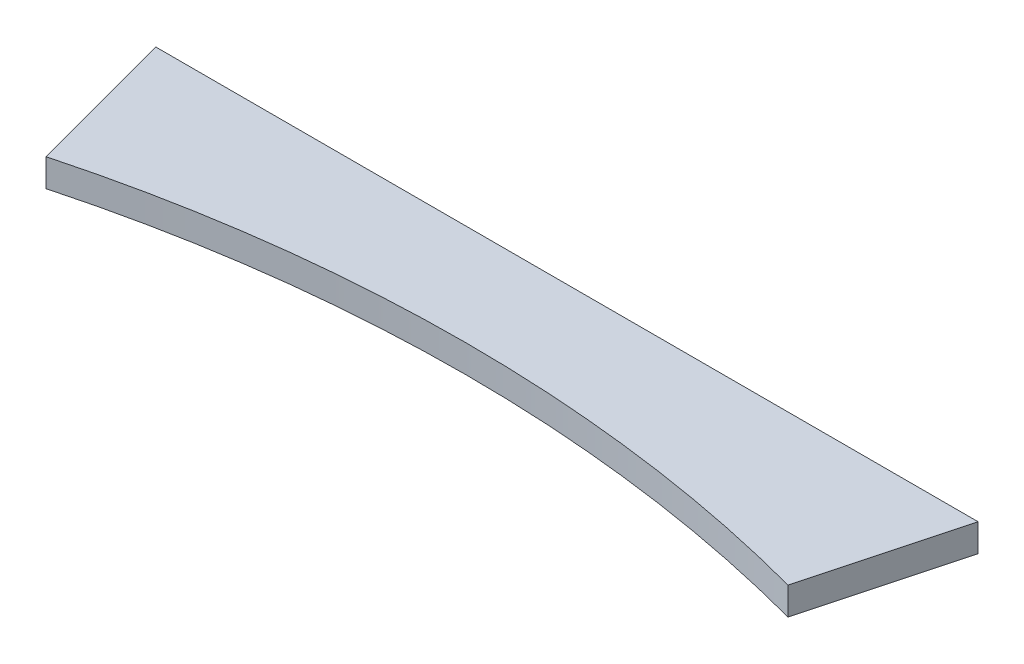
ISO-10303-21;
HEADER;
FILE_DESCRIPTION(('STEP AP214'),'2;1');
FILE_NAME('part.step','',(''),(''),'','','');
FILE_SCHEMA(('AUTOMOTIVE_DESIGN { 1 0 10303 214 1 1 1 1 }'));
ENDSEC;
DATA;
#1=APPLICATION_CONTEXT('core data for automotive mechanical design processes');
#2=APPLICATION_PROTOCOL_DEFINITION('international standard','automotive_design',2000,#1);
#3=PRODUCT_CONTEXT('',#1,'mechanical');
#4=PRODUCT('Part','Part','',(#3));
#5=PRODUCT_RELATED_PRODUCT_CATEGORY('part','',(#4));
#6=PRODUCT_DEFINITION_FORMATION('','',#4);
#7=PRODUCT_DEFINITION_CONTEXT('part definition',#1,'design');
#8=PRODUCT_DEFINITION('design','',#6,#7);
#9=PRODUCT_DEFINITION_SHAPE('','',#8);
#10=(LENGTH_UNIT() NAMED_UNIT(*) SI_UNIT(.MILLI.,.METRE.));
#11=(NAMED_UNIT(*) PLANE_ANGLE_UNIT() SI_UNIT($,.RADIAN.));
#12=(NAMED_UNIT(*) SI_UNIT($,.STERADIAN.) SOLID_ANGLE_UNIT());
#13=UNCERTAINTY_MEASURE_WITH_UNIT(LENGTH_MEASURE(1.E-05),#10,'distance_accuracy_value','');
#14=(GEOMETRIC_REPRESENTATION_CONTEXT(3) GLOBAL_UNCERTAINTY_ASSIGNED_CONTEXT((#13)) GLOBAL_UNIT_ASSIGNED_CONTEXT((#10,
#11,#12)) REPRESENTATION_CONTEXT('',''));
#15=CARTESIAN_POINT('',(0.,0.,0.));
#16=DIRECTION('',(0.,0.,1.));
#17=DIRECTION('',(1.,0.,0.));
#18=AXIS2_PLACEMENT_3D('',#15,#16,#17);
#19=CARTESIAN_POINT('',(0.,15.,830.7));
#20=DIRECTION('',(0.,-1.,0.));
#21=DIRECTION('',(0.,0.,-1.));
#22=AXIS2_PLACEMENT_3D('',#19,#20,#21);
#23=CYLINDRICAL_SURFACE('',#22,776.);
#24=CARTESIAN_POINT('',(0.,0.,830.7));
#25=DIRECTION('',(0.,1.,0.));
#26=DIRECTION('',(0.,0.,1.));
#27=AXIS2_PLACEMENT_3D('',#24,#25,#26);
#28=CIRCLE('',#27,776.);
#29=CARTESIAN_POINT('',(200.771684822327,0.,81.1222985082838));
#30=VERTEX_POINT('',#29);
#31=CARTESIAN_POINT('',(-200.771684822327,0.,81.1222985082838));
#32=VERTEX_POINT('',#31);
#33=EDGE_CURVE('E95',#30,#32,#28,.T.);
#34=ORIENTED_EDGE('',*,*,#33,.F.);
#35=DIRECTION('',(0.,-1.,0.));
#36=VECTOR('',#35,1.);
#37=CARTESIAN_POINT('',(200.771684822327,15.,81.1222985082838));
#38=LINE('',#37,#36);
#39=CARTESIAN_POINT('',(200.771684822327,15.,81.1222985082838));
#40=VERTEX_POINT('',#39);
#41=EDGE_CURVE('E11',#40,#30,#38,.T.);
#42=ORIENTED_EDGE('',*,*,#41,.F.);
#43=CARTESIAN_POINT('',(0.,15.,830.7));
#44=DIRECTION('',(0.,1.,0.));
#45=DIRECTION('',(0.,0.,1.));
#46=AXIS2_PLACEMENT_3D('',#43,#44,#45);
#47=CIRCLE('',#46,776.);
#48=CARTESIAN_POINT('',(-200.771684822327,15.,81.1222985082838));
#49=VERTEX_POINT('',#48);
#50=EDGE_CURVE('E80',#40,#49,#47,.T.);
#51=ORIENTED_EDGE('',*,*,#50,.T.);
#52=DIRECTION('',(0.,-1.,0.));
#53=VECTOR('',#52,1.);
#54=CARTESIAN_POINT('',(-200.771684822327,15.,81.1222985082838));
#55=LINE('',#54,#53);
#56=EDGE_CURVE('E70',#49,#32,#55,.T.);
#57=ORIENTED_EDGE('',*,*,#56,.T.);
#58=EDGE_LOOP('',(#34,#42,#51,#57));
#59=FACE_BOUND('',#58,.T.);
#60=ADVANCED_FACE('F32',(#59),#23,.F.);
#61=CARTESIAN_POINT('',(207.605994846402,15.,55.6065172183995));
#62=DIRECTION('',(-0.965950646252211,0.,-0.258726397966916));
#63=DIRECTION('',(-0.258726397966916,0.,0.965950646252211));
#64=AXIS2_PLACEMENT_3D('',#61,#62,#63);
#65=PLANE('',#64);
#66=DIRECTION('',(0.258726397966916,0.,-0.965950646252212));
#67=VECTOR('',#66,1.);
#68=CARTESIAN_POINT('',(207.605994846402,0.,55.6065172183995));
#69=LINE('',#68,#67);
#70=CARTESIAN_POINT('',(222.5,0.,0.));
#71=VERTEX_POINT('',#70);
#72=EDGE_CURVE('E86',#30,#71,#69,.T.);
#73=ORIENTED_EDGE('',*,*,#72,.T.);
#74=DIRECTION('',(0.,-1.,0.));
#75=VECTOR('',#74,1.);
#76=CARTESIAN_POINT('',(222.5,15.,0.));
#77=LINE('',#76,#75);
#78=CARTESIAN_POINT('',(222.5,15.,0.));
#79=VERTEX_POINT('',#78);
#80=EDGE_CURVE('E40',#79,#71,#77,.T.);
#81=ORIENTED_EDGE('',*,*,#80,.F.);
#82=DIRECTION('',(0.258726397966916,0.,-0.965950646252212));
#83=VECTOR('',#82,1.);
#84=CARTESIAN_POINT('',(207.605994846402,15.,55.6065172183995));
#85=LINE('',#84,#83);
#86=EDGE_CURVE('E75',#40,#79,#85,.T.);
#87=ORIENTED_EDGE('',*,*,#86,.F.);
#88=ORIENTED_EDGE('',*,*,#41,.T.);
#89=EDGE_LOOP('',(#73,#81,#87,#88));
#90=FACE_BOUND('',#89,.T.);
#91=ADVANCED_FACE('F84',(#90),#65,.F.);
#92=CARTESIAN_POINT('',(0.,15.,0.));
#93=DIRECTION('',(0.,0.,-1.));
#94=DIRECTION('',(-1.,0.,0.));
#95=AXIS2_PLACEMENT_3D('',#92,#93,#94);
#96=PLANE('',#95);
#97=DIRECTION('',(1.,0.,0.));
#98=VECTOR('',#97,1.);
#99=CARTESIAN_POINT('',(0.,0.,0.));
#100=LINE('',#99,#98);
#101=CARTESIAN_POINT('',(-222.5,0.,0.));
#102=VERTEX_POINT('',#101);
#103=EDGE_CURVE('E99',#102,#71,#100,.T.);
#104=ORIENTED_EDGE('',*,*,#103,.F.);
#105=DIRECTION('',(0.,-1.,0.));
#106=VECTOR('',#105,1.);
#107=CARTESIAN_POINT('',(-222.5,15.,0.));
#108=LINE('',#107,#106);
#109=CARTESIAN_POINT('',(-222.5,15.,0.));
#110=VERTEX_POINT('',#109);
#111=EDGE_CURVE('E63',#110,#102,#108,.T.);
#112=ORIENTED_EDGE('',*,*,#111,.F.);
#113=DIRECTION('',(1.,0.,0.));
#114=VECTOR('',#113,1.);
#115=CARTESIAN_POINT('',(0.,15.,0.));
#116=LINE('',#115,#114);
#117=EDGE_CURVE('E79',#110,#79,#116,.T.);
#118=ORIENTED_EDGE('',*,*,#117,.T.);
#119=ORIENTED_EDGE('',*,*,#80,.T.);
#120=EDGE_LOOP('',(#104,#112,#118,#119));
#121=FACE_BOUND('',#120,.T.);
#122=ADVANCED_FACE('F90',(#121),#96,.T.);
#123=CARTESIAN_POINT('',(-207.605994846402,15.,55.6065172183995));
#124=DIRECTION('',(0.965950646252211,0.,-0.258726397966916));
#125=DIRECTION('',(-0.258726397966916,0.,-0.965950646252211));
#126=AXIS2_PLACEMENT_3D('',#123,#124,#125);
#127=PLANE('',#126);
#128=DIRECTION('',(0.258726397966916,0.,0.965950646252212));
#129=VECTOR('',#128,1.);
#130=CARTESIAN_POINT('',(-207.605994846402,0.,55.6065172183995));
#131=LINE('',#130,#129);
#132=EDGE_CURVE('E101',#102,#32,#131,.T.);
#133=ORIENTED_EDGE('',*,*,#132,.T.);
#134=ORIENTED_EDGE('',*,*,#56,.F.);
#135=DIRECTION('',(0.258726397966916,0.,0.965950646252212));
#136=VECTOR('',#135,1.);
#137=CARTESIAN_POINT('',(-207.605994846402,15.,55.6065172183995));
#138=LINE('',#137,#136);
#139=EDGE_CURVE('E48',#110,#49,#138,.T.);
#140=ORIENTED_EDGE('',*,*,#139,.F.);
#141=ORIENTED_EDGE('',*,*,#111,.T.);
#142=EDGE_LOOP('',(#133,#134,#140,#141));
#143=FACE_BOUND('',#142,.T.);
#144=ADVANCED_FACE('F111',(#143),#127,.F.);
#145=CARTESIAN_POINT('',(0.,15.,0.));
#146=DIRECTION('',(0.,1.,0.));
#147=DIRECTION('',(0.,0.,1.));
#148=AXIS2_PLACEMENT_3D('',#145,#146,#147);
#149=PLANE('',#148);
#150=ORIENTED_EDGE('',*,*,#50,.F.);
#151=ORIENTED_EDGE('',*,*,#86,.T.);
#152=ORIENTED_EDGE('',*,*,#117,.F.);
#153=ORIENTED_EDGE('',*,*,#139,.T.);
#154=EDGE_LOOP('',(#150,#151,#152,#153));
#155=FACE_BOUND('',#154,.T.);
#156=ADVANCED_FACE('F77',(#155),#149,.T.);
#157=CARTESIAN_POINT('',(0.,0.,0.));
#158=DIRECTION('',(0.,1.,0.));
#159=DIRECTION('',(0.,0.,1.));
#160=AXIS2_PLACEMENT_3D('',#157,#158,#159);
#161=PLANE('',#160);
#162=ORIENTED_EDGE('',*,*,#33,.T.);
#163=ORIENTED_EDGE('',*,*,#132,.F.);
#164=ORIENTED_EDGE('',*,*,#103,.T.);
#165=ORIENTED_EDGE('',*,*,#72,.F.);
#166=EDGE_LOOP('',(#162,#163,#164,#165));
#167=FACE_BOUND('',#166,.T.);
#168=ADVANCED_FACE('F116',(#167),#161,.F.);
#169=CLOSED_SHELL('',(#60,#91,#122,#144,#156,#168));
#170=MANIFOLD_SOLID_BREP('B2',#169);
#171=ADVANCED_BREP_SHAPE_REPRESENTATION('',(#18,#170),#14);
#172=SHAPE_DEFINITION_REPRESENTATION(#9,#171);
ENDSEC;
END-ISO-10303-21;
